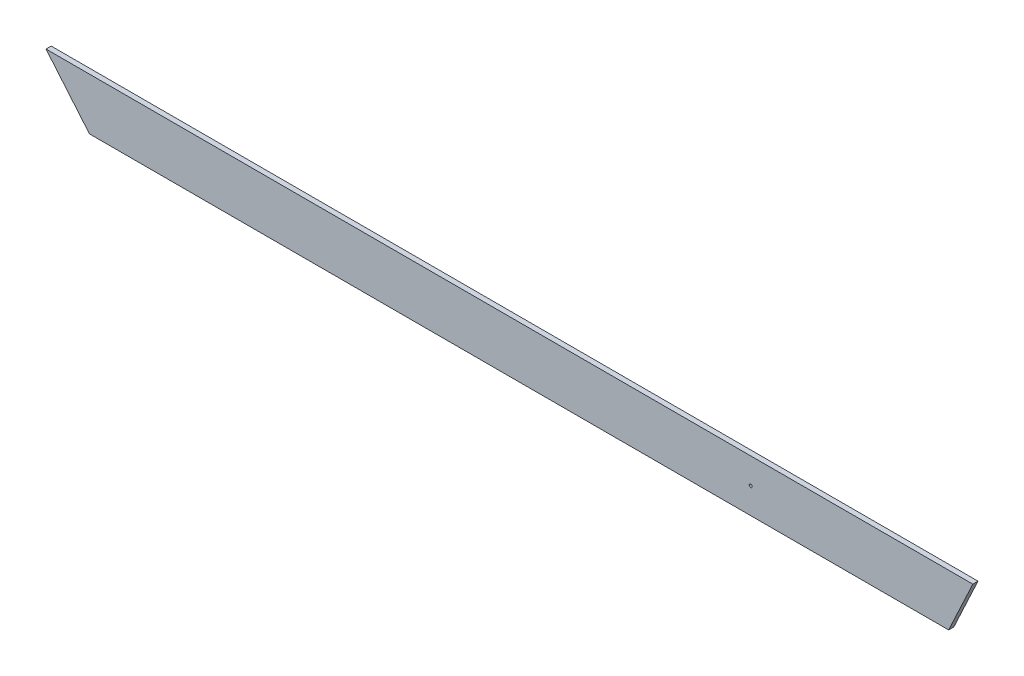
ISO-10303-21;
HEADER;
FILE_DESCRIPTION(('STEP AP214'),'2;1');
FILE_NAME('part.step','',(''),(''),'','','');
FILE_SCHEMA(('AUTOMOTIVE_DESIGN { 1 0 10303 214 1 1 1 1 }'));
ENDSEC;
DATA;
#1=APPLICATION_CONTEXT('core data for automotive mechanical design processes');
#2=APPLICATION_PROTOCOL_DEFINITION('international standard','automotive_design',2000,#1);
#3=PRODUCT_CONTEXT('',#1,'mechanical');
#4=PRODUCT('Part','Part','',(#3));
#5=PRODUCT_RELATED_PRODUCT_CATEGORY('part','',(#4));
#6=PRODUCT_DEFINITION_FORMATION('','',#4);
#7=PRODUCT_DEFINITION_CONTEXT('part definition',#1,'design');
#8=PRODUCT_DEFINITION('design','',#6,#7);
#9=PRODUCT_DEFINITION_SHAPE('','',#8);
#10=(LENGTH_UNIT() NAMED_UNIT(*) SI_UNIT(.MILLI.,.METRE.));
#11=(NAMED_UNIT(*) PLANE_ANGLE_UNIT() SI_UNIT($,.RADIAN.));
#12=(NAMED_UNIT(*) SI_UNIT($,.STERADIAN.) SOLID_ANGLE_UNIT());
#13=UNCERTAINTY_MEASURE_WITH_UNIT(LENGTH_MEASURE(1.E-05),#10,'distance_accuracy_value','');
#14=(GEOMETRIC_REPRESENTATION_CONTEXT(3) GLOBAL_UNCERTAINTY_ASSIGNED_CONTEXT((#13)) GLOBAL_UNIT_ASSIGNED_CONTEXT((#10,
#11,#12)) REPRESENTATION_CONTEXT('',''));
#15=CARTESIAN_POINT('',(0.,0.,0.));
#16=DIRECTION('',(0.,0.,1.));
#17=DIRECTION('',(1.,0.,0.));
#18=AXIS2_PLACEMENT_3D('',#15,#16,#17);
#19=CARTESIAN_POINT('',(-405.545018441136,0.,5.));
#20=DIRECTION('',(0.766044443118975,0.642787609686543,0.));
#21=DIRECTION('',(-0.642787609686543,0.766044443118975,0.));
#22=AXIS2_PLACEMENT_3D('',#19,#20,#21);
#23=PLANE('',#22);
#24=DIRECTION('',(0.642787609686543,-0.766044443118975,0.));
#25=VECTOR('',#24,1.);
#26=CARTESIAN_POINT('',(-405.545018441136,0.,0.));
#27=LINE('',#26,#25);
#28=CARTESIAN_POINT('',(-447.5,50.,0.));
#29=VERTEX_POINT('',#28);
#30=CARTESIAN_POINT('',(-405.545018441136,0.,0.));
#31=VERTEX_POINT('',#30);
#32=EDGE_CURVE('E98',#29,#31,#27,.T.);
#33=ORIENTED_EDGE('',*,*,#32,.T.);
#34=DIRECTION('',(0.,0.,-1.));
#35=VECTOR('',#34,1.);
#36=CARTESIAN_POINT('',(-405.545018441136,0.,5.));
#37=LINE('',#36,#35);
#38=CARTESIAN_POINT('',(-405.545018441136,0.,5.));
#39=VERTEX_POINT('',#38);
#40=EDGE_CURVE('E11',#39,#31,#37,.T.);
#41=ORIENTED_EDGE('',*,*,#40,.F.);
#42=DIRECTION('',(0.642787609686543,-0.766044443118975,0.));
#43=VECTOR('',#42,1.);
#44=CARTESIAN_POINT('',(-405.545018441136,0.,5.));
#45=LINE('',#44,#43);
#46=CARTESIAN_POINT('',(-447.5,50.,5.));
#47=VERTEX_POINT('',#46);
#48=EDGE_CURVE('E85',#47,#39,#45,.T.);
#49=ORIENTED_EDGE('',*,*,#48,.F.);
#50=DIRECTION('',(0.,0.,-1.));
#51=VECTOR('',#50,1.);
#52=CARTESIAN_POINT('',(-447.5,50.,5.));
#53=LINE('',#52,#51);
#54=EDGE_CURVE('E94',#47,#29,#53,.T.);
#55=ORIENTED_EDGE('',*,*,#54,.T.);
#56=EDGE_LOOP('',(#33,#41,#49,#55));
#57=FACE_BOUND('',#56,.T.);
#58=ADVANCED_FACE('F33',(#57),#23,.F.);
#59=CARTESIAN_POINT('',(-405.545018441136,0.,5.));
#60=DIRECTION('',(0.,1.,0.));
#61=DIRECTION('',(0.,0.,1.));
#62=AXIS2_PLACEMENT_3D('',#59,#60,#61);
#63=PLANE('',#62);
#64=DIRECTION('',(1.,0.,0.));
#65=VECTOR('',#64,1.);
#66=CARTESIAN_POINT('',(-405.545018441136,0.,0.));
#67=LINE('',#66,#65);
#68=CARTESIAN_POINT('',(424.18461709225,0.,0.));
#69=VERTEX_POINT('',#68);
#70=EDGE_CURVE('E89',#31,#69,#67,.T.);
#71=ORIENTED_EDGE('',*,*,#70,.T.);
#72=DIRECTION('',(0.,0.,-1.));
#73=VECTOR('',#72,1.);
#74=CARTESIAN_POINT('',(424.18461709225,0.,5.));
#75=LINE('',#74,#73);
#76=CARTESIAN_POINT('',(424.18461709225,0.,5.));
#77=VERTEX_POINT('',#76);
#78=EDGE_CURVE('E42',#77,#69,#75,.T.);
#79=ORIENTED_EDGE('',*,*,#78,.F.);
#80=DIRECTION('',(1.,0.,0.));
#81=VECTOR('',#80,1.);
#82=CARTESIAN_POINT('',(-405.545018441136,0.,5.));
#83=LINE('',#82,#81);
#84=EDGE_CURVE('E80',#39,#77,#83,.T.);
#85=ORIENTED_EDGE('',*,*,#84,.F.);
#86=ORIENTED_EDGE('',*,*,#40,.T.);
#87=EDGE_LOOP('',(#71,#79,#85,#86));
#88=FACE_BOUND('',#87,.T.);
#89=ADVANCED_FACE('F88',(#88),#63,.F.);
#90=CARTESIAN_POINT('',(424.18461709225,0.,5.));
#91=DIRECTION('',(-0.906307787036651,0.422618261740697,0.));
#92=DIRECTION('',(-0.422618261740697,-0.906307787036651,0.));
#93=AXIS2_PLACEMENT_3D('',#90,#91,#92);
#94=PLANE('',#93);
#95=DIRECTION('',(0.422618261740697,0.906307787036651,0.));
#96=VECTOR('',#95,1.);
#97=CARTESIAN_POINT('',(424.18461709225,0.,0.));
#98=LINE('',#97,#96);
#99=CARTESIAN_POINT('',(447.5,50.,0.));
#100=VERTEX_POINT('',#99);
#101=EDGE_CURVE('E67',#69,#100,#98,.T.);
#102=ORIENTED_EDGE('',*,*,#101,.T.);
#103=DIRECTION('',(0.,0.,-1.));
#104=VECTOR('',#103,1.);
#105=CARTESIAN_POINT('',(447.5,50.,5.));
#106=LINE('',#105,#104);
#107=CARTESIAN_POINT('',(447.5,50.,5.));
#108=VERTEX_POINT('',#107);
#109=EDGE_CURVE('E90',#108,#100,#106,.T.);
#110=ORIENTED_EDGE('',*,*,#109,.F.);
#111=DIRECTION('',(0.422618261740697,0.906307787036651,0.));
#112=VECTOR('',#111,1.);
#113=CARTESIAN_POINT('',(424.18461709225,0.,5.));
#114=LINE('',#113,#112);
#115=EDGE_CURVE('E83',#77,#108,#114,.T.);
#116=ORIENTED_EDGE('',*,*,#115,.F.);
#117=ORIENTED_EDGE('',*,*,#78,.T.);
#118=EDGE_LOOP('',(#102,#110,#116,#117));
#119=FACE_BOUND('',#118,.T.);
#120=ADVANCED_FACE('F92',(#119),#94,.F.);
#121=CARTESIAN_POINT('',(-447.5,50.,5.));
#122=DIRECTION('',(0.,-1.,0.));
#123=DIRECTION('',(0.,0.,-1.));
#124=AXIS2_PLACEMENT_3D('',#121,#122,#123);
#125=PLANE('',#124);
#126=DIRECTION('',(-1.,0.,0.));
#127=VECTOR('',#126,1.);
#128=CARTESIAN_POINT('',(-447.5,50.,0.));
#129=LINE('',#128,#127);
#130=EDGE_CURVE('E73',#100,#29,#129,.T.);
#131=ORIENTED_EDGE('',*,*,#130,.T.);
#132=ORIENTED_EDGE('',*,*,#54,.F.);
#133=DIRECTION('',(-1.,0.,0.));
#134=VECTOR('',#133,1.);
#135=CARTESIAN_POINT('',(-447.5,50.,5.));
#136=LINE('',#135,#134);
#137=EDGE_CURVE('E50',#108,#47,#136,.T.);
#138=ORIENTED_EDGE('',*,*,#137,.F.);
#139=ORIENTED_EDGE('',*,*,#109,.T.);
#140=EDGE_LOOP('',(#131,#132,#138,#139));
#141=FACE_BOUND('',#140,.T.);
#142=ADVANCED_FACE('F105',(#141),#125,.F.);
#143=CARTESIAN_POINT('',(0.,0.,5.));
#144=DIRECTION('',(0.,0.,-1.));
#145=DIRECTION('',(-1.,0.,0.));
#146=AXIS2_PLACEMENT_3D('',#143,#144,#145);
#147=PLANE('',#146);
#148=CARTESIAN_POINT('',(233.,25.,5.));
#149=DIRECTION('',(0.,0.,1.));
#150=DIRECTION('',(1.,0.,0.));
#151=AXIS2_PLACEMENT_3D('',#148,#149,#150);
#152=CIRCLE('',#151,1.5);
#153=CARTESIAN_POINT('',(234.5,25.,5.));
#154=VERTEX_POINT('',#153);
#155=EDGE_CURVE('E111',#154,#154,#152,.T.);
#156=ORIENTED_EDGE('',*,*,#155,.F.);
#157=EDGE_LOOP('',(#156));
#158=FACE_BOUND('',#157,.T.);
#159=ORIENTED_EDGE('',*,*,#48,.T.);
#160=ORIENTED_EDGE('',*,*,#84,.T.);
#161=ORIENTED_EDGE('',*,*,#115,.T.);
#162=ORIENTED_EDGE('',*,*,#137,.T.);
#163=EDGE_LOOP('',(#159,#160,#161,#162));
#164=FACE_BOUND('',#163,.T.);
#165=ADVANCED_FACE('F81',(#158,#164),#147,.F.);
#166=CARTESIAN_POINT('',(0.,0.,0.));
#167=DIRECTION('',(0.,0.,-1.));
#168=DIRECTION('',(-1.,0.,0.));
#169=AXIS2_PLACEMENT_3D('',#166,#167,#168);
#170=PLANE('',#169);
#171=CARTESIAN_POINT('',(233.,25.,0.));
#172=DIRECTION('',(0.,0.,-1.));
#173=DIRECTION('',(-1.,0.,0.));
#174=AXIS2_PLACEMENT_3D('',#171,#172,#173);
#175=CIRCLE('',#174,1.5);
#176=CARTESIAN_POINT('',(231.5,25.,0.));
#177=VERTEX_POINT('',#176);
#178=EDGE_CURVE('E36',#177,#177,#175,.T.);
#179=ORIENTED_EDGE('',*,*,#178,.F.);
#180=EDGE_LOOP('',(#179));
#181=FACE_BOUND('',#180,.T.);
#182=ORIENTED_EDGE('',*,*,#32,.F.);
#183=ORIENTED_EDGE('',*,*,#130,.F.);
#184=ORIENTED_EDGE('',*,*,#101,.F.);
#185=ORIENTED_EDGE('',*,*,#70,.F.);
#186=EDGE_LOOP('',(#182,#183,#184,#185));
#187=FACE_BOUND('',#186,.T.);
#188=ADVANCED_FACE('F108',(#181,#187),#170,.T.);
#189=CARTESIAN_POINT('',(233.,25.,-5.));
#190=DIRECTION('',(0.,0.,1.));
#191=DIRECTION('',(1.,0.,0.));
#192=AXIS2_PLACEMENT_3D('',#189,#190,#191);
#193=CYLINDRICAL_SURFACE('',#192,1.5);
#194=ORIENTED_EDGE('',*,*,#178,.T.);
#195=EDGE_LOOP('',(#194));
#196=FACE_BOUND('',#195,.T.);
#197=ORIENTED_EDGE('',*,*,#155,.T.);
#198=EDGE_LOOP('',(#197));
#199=FACE_BOUND('',#198,.T.);
#200=ADVANCED_FACE('F118',(#196,#199),#193,.F.);
#201=CLOSED_SHELL('',(#58,#89,#120,#142,#165,#188,#200));
#202=MANIFOLD_SOLID_BREP('B2',#201);
#203=ADVANCED_BREP_SHAPE_REPRESENTATION('',(#18,#202),#14);
#204=SHAPE_DEFINITION_REPRESENTATION(#9,#203);
ENDSEC;
END-ISO-10303-21;
